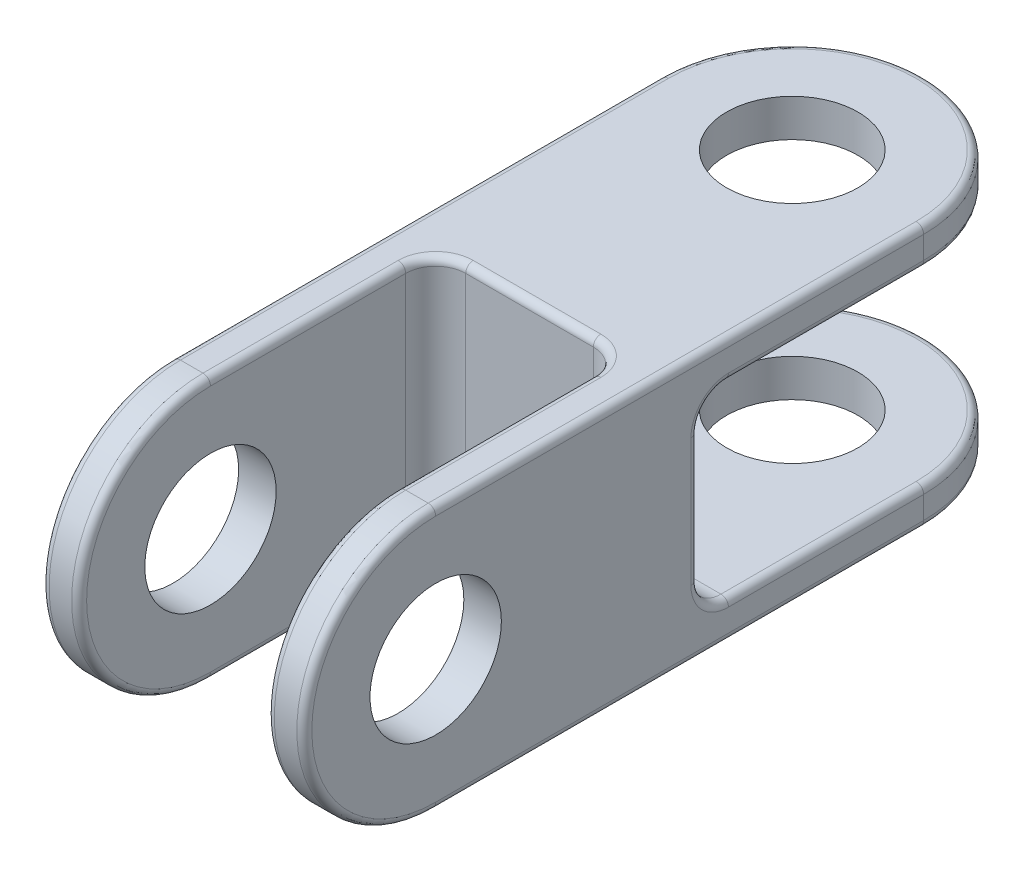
ISO-10303-21;
HEADER;
FILE_DESCRIPTION(('STEP AP214'),'2;1');
FILE_NAME('part.step','',(''),(''),'','','');
FILE_SCHEMA(('AUTOMOTIVE_DESIGN { 1 0 10303 214 1 1 1 1 }'));
ENDSEC;
DATA;
#1=APPLICATION_CONTEXT('core data for automotive mechanical design processes');
#2=APPLICATION_PROTOCOL_DEFINITION('international standard','automotive_design',2000,#1);
#3=PRODUCT_CONTEXT('',#1,'mechanical');
#4=PRODUCT('Part','Part','',(#3));
#5=PRODUCT_RELATED_PRODUCT_CATEGORY('part','',(#4));
#6=PRODUCT_DEFINITION_FORMATION('','',#4);
#7=PRODUCT_DEFINITION_CONTEXT('part definition',#1,'design');
#8=PRODUCT_DEFINITION('design','',#6,#7);
#9=PRODUCT_DEFINITION_SHAPE('','',#8);
#10=(LENGTH_UNIT() NAMED_UNIT(*) SI_UNIT(.MILLI.,.METRE.));
#11=(NAMED_UNIT(*) PLANE_ANGLE_UNIT() SI_UNIT($,.RADIAN.));
#12=(NAMED_UNIT(*) SI_UNIT($,.STERADIAN.) SOLID_ANGLE_UNIT());
#13=UNCERTAINTY_MEASURE_WITH_UNIT(LENGTH_MEASURE(1.E-05),#10,'distance_accuracy_value','');
#14=(GEOMETRIC_REPRESENTATION_CONTEXT(3) GLOBAL_UNCERTAINTY_ASSIGNED_CONTEXT((#13)) GLOBAL_UNIT_ASSIGNED_CONTEXT((#10,
#11,#12)) REPRESENTATION_CONTEXT('',''));
#15=CARTESIAN_POINT('',(0.,0.,0.));
#16=DIRECTION('',(0.,0.,1.));
#17=DIRECTION('',(1.,0.,0.));
#18=AXIS2_PLACEMENT_3D('',#15,#16,#17);
#19=CARTESIAN_POINT('',(0.,0.,0.));
#20=DIRECTION('',(0.,0.,-1.));
#21=DIRECTION('',(-1.,0.,0.));
#22=AXIS2_PLACEMENT_3D('',#19,#20,#21);
#23=PLANE('',#22);
#24=DIRECTION('',(1.,0.,0.));
#25=VECTOR('',#24,1.);
#26=CARTESIAN_POINT('',(0.,18.,0.));
#27=LINE('',#26,#25);
#28=CARTESIAN_POINT('',(68.,18.,0.));
#29=VERTEX_POINT('',#28);
#30=CARTESIAN_POINT('',(2.,18.,0.));
#31=VERTEX_POINT('',#30);
#32=EDGE_CURVE('E529',#29,#31,#27,.F.);
#33=ORIENTED_EDGE('',*,*,#32,.T.);
#34=DIRECTION('',(0.,-1.,0.));
#35=VECTOR('',#34,1.);
#36=CARTESIAN_POINT('',(1.99999999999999,52.,0.));
#37=LINE('',#36,#35);
#38=CARTESIAN_POINT('',(1.99999999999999,52.,0.));
#39=VERTEX_POINT('',#38);
#40=EDGE_CURVE('E322',#31,#39,#37,.F.);
#41=ORIENTED_EDGE('',*,*,#40,.T.);
#42=DIRECTION('',(1.,0.,0.));
#43=VECTOR('',#42,1.);
#44=CARTESIAN_POINT('',(70.,52.,0.));
#45=LINE('',#44,#43);
#46=CARTESIAN_POINT('',(68.,52.,0.));
#47=VERTEX_POINT('',#46);
#48=EDGE_CURVE('E532',#39,#47,#45,.T.);
#49=ORIENTED_EDGE('',*,*,#48,.T.);
#50=DIRECTION('',(0.,1.,0.));
#51=VECTOR('',#50,1.);
#52=CARTESIAN_POINT('',(68.,18.,0.));
#53=LINE('',#52,#51);
#54=EDGE_CURVE('E320',#47,#29,#53,.F.);
#55=ORIENTED_EDGE('',*,*,#54,.T.);
#56=EDGE_LOOP('',(#33,#41,#49,#55));
#57=FACE_BOUND('',#56,.T.);
#58=ADVANCED_FACE('F34',(#57),#23,.T.);
#59=CARTESIAN_POINT('',(0.,0.,10.));
#60=DIRECTION('',(0.,0.,-1.));
#61=DIRECTION('',(-1.,0.,0.));
#62=AXIS2_PLACEMENT_3D('',#59,#60,#61);
#63=PLANE('',#62);
#64=DIRECTION('',(0.,1.,0.));
#65=VECTOR('',#64,1.);
#66=CARTESIAN_POINT('',(52.,0.,10.));
#67=LINE('',#66,#65);
#68=CARTESIAN_POINT('',(52.,2.,10.));
#69=VERTEX_POINT('',#68);
#70=CARTESIAN_POINT('',(52.,68.,10.));
#71=VERTEX_POINT('',#70);
#72=EDGE_CURVE('E544',#69,#71,#67,.T.);
#73=ORIENTED_EDGE('',*,*,#72,.T.);
#74=DIRECTION('',(-1.,0.,0.));
#75=VECTOR('',#74,1.);
#76=CARTESIAN_POINT('',(0.,68.,10.));
#77=LINE('',#76,#75);
#78=CARTESIAN_POINT('',(18.,68.,10.));
#79=VERTEX_POINT('',#78);
#80=EDGE_CURVE('E362',#71,#79,#77,.T.);
#81=ORIENTED_EDGE('',*,*,#80,.T.);
#82=DIRECTION('',(0.,1.,0.));
#83=VECTOR('',#82,1.);
#84=CARTESIAN_POINT('',(18.,0.,10.));
#85=LINE('',#84,#83);
#86=CARTESIAN_POINT('',(18.,2.,10.));
#87=VERTEX_POINT('',#86);
#88=EDGE_CURVE('E541',#79,#87,#85,.F.);
#89=ORIENTED_EDGE('',*,*,#88,.T.);
#90=DIRECTION('',(1.,0.,0.));
#91=VECTOR('',#90,1.);
#92=CARTESIAN_POINT('',(0.,2.,10.));
#93=LINE('',#92,#91);
#94=EDGE_CURVE('E360',#87,#69,#93,.T.);
#95=ORIENTED_EDGE('',*,*,#94,.T.);
#96=EDGE_LOOP('',(#73,#81,#89,#95));
#97=FACE_BOUND('',#96,.T.);
#98=ADVANCED_FACE('F617',(#97),#63,.F.);
#99=CARTESIAN_POINT('',(0.,0.,10.));
#100=DIRECTION('',(1.,0.,0.));
#101=DIRECTION('',(0.,1.,0.));
#102=AXIS2_PLACEMENT_3D('',#99,#100,#101);
#103=PLANE('',#102);
#104=CARTESIAN_POINT('',(0.,18.,-8.));
#105=DIRECTION('',(1.,0.,0.));
#106=DIRECTION('',(0.,1.,0.));
#107=AXIS2_PLACEMENT_3D('',#104,#105,#106);
#108=CIRCLE('',#107,10.);
#109=CARTESIAN_POINT('',(0.,18.,2.));
#110=VERTEX_POINT('',#109);
#111=CARTESIAN_POINT('',(0.,7.99999999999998,-8.));
#112=VERTEX_POINT('',#111);
#113=EDGE_CURVE('E316',#110,#112,#108,.T.);
#114=ORIENTED_EDGE('',*,*,#113,.T.);
#115=DIRECTION('',(0.,0.,1.));
#116=VECTOR('',#115,1.);
#117=CARTESIAN_POINT('',(0.,7.99999999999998,10.));
#118=LINE('',#117,#116);
#119=CARTESIAN_POINT('',(0.,7.99999999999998,-60.));
#120=VERTEX_POINT('',#119);
#121=EDGE_CURVE('E318',#112,#120,#118,.F.);
#122=ORIENTED_EDGE('',*,*,#121,.T.);
#123=DIRECTION('',(0.,-1.,0.));
#124=VECTOR('',#123,1.);
#125=CARTESIAN_POINT('',(0.,9.99999999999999,-60.));
#126=LINE('',#125,#124);
#127=CARTESIAN_POINT('',(0.,2.,-60.));
#128=VERTEX_POINT('',#127);
#129=EDGE_CURVE('E250',#120,#128,#126,.T.);
#130=ORIENTED_EDGE('',*,*,#129,.T.);
#131=DIRECTION('',(0.,0.,-1.));
#132=VECTOR('',#131,1.);
#133=CARTESIAN_POINT('',(0.,2.,10.));
#134=LINE('',#133,#132);
#135=CARTESIAN_POINT('',(0.,1.99999999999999,70.));
#136=VERTEX_POINT('',#135);
#137=EDGE_CURVE('E308',#128,#136,#134,.F.);
#138=ORIENTED_EDGE('',*,*,#137,.T.);
#139=CARTESIAN_POINT('',(0.,35.,70.));
#140=DIRECTION('',(1.,0.,0.));
#141=DIRECTION('',(0.,1.,0.));
#142=AXIS2_PLACEMENT_3D('',#139,#140,#141);
#143=CIRCLE('',#142,33.);
#144=CARTESIAN_POINT('',(0.,68.,70.));
#145=VERTEX_POINT('',#144);
#146=EDGE_CURVE('E305',#136,#145,#143,.F.);
#147=ORIENTED_EDGE('',*,*,#146,.T.);
#148=DIRECTION('',(0.,0.,-1.));
#149=VECTOR('',#148,1.);
#150=CARTESIAN_POINT('',(0.,68.,10.));
#151=LINE('',#150,#149);
#152=CARTESIAN_POINT('',(0.,68.,-60.));
#153=VERTEX_POINT('',#152);
#154=EDGE_CURVE('E255',#145,#153,#151,.T.);
#155=ORIENTED_EDGE('',*,*,#154,.T.);
#156=DIRECTION('',(0.,-1.,0.));
#157=VECTOR('',#156,1.);
#158=CARTESIAN_POINT('',(0.,70.,-60.));
#159=LINE('',#158,#157);
#160=CARTESIAN_POINT('',(0.,62.,-60.));
#161=VERTEX_POINT('',#160);
#162=EDGE_CURVE('E499',#153,#161,#159,.T.);
#163=ORIENTED_EDGE('',*,*,#162,.T.);
#164=DIRECTION('',(0.,0.,1.));
#165=VECTOR('',#164,1.);
#166=CARTESIAN_POINT('',(0.,62.,-7.99999999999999));
#167=LINE('',#166,#165);
#168=CARTESIAN_POINT('',(0.,62.,-8.));
#169=VERTEX_POINT('',#168);
#170=EDGE_CURVE('E310',#161,#169,#167,.T.);
#171=ORIENTED_EDGE('',*,*,#170,.T.);
#172=CARTESIAN_POINT('',(0.,52.,-8.));
#173=DIRECTION('',(1.,0.,0.));
#174=DIRECTION('',(0.,1.,0.));
#175=AXIS2_PLACEMENT_3D('',#172,#173,#174);
#176=CIRCLE('',#175,10.);
#177=CARTESIAN_POINT('',(0.,52.,2.));
#178=VERTEX_POINT('',#177);
#179=EDGE_CURVE('E312',#169,#178,#176,.T.);
#180=ORIENTED_EDGE('',*,*,#179,.T.);
#181=DIRECTION('',(0.,-1.,0.));
#182=VECTOR('',#181,1.);
#183=CARTESIAN_POINT('',(0.,18.,2.));
#184=LINE('',#183,#182);
#185=EDGE_CURVE('E314',#178,#110,#184,.T.);
#186=ORIENTED_EDGE('',*,*,#185,.T.);
#187=EDGE_LOOP('',(#114,#122,#130,#138,#147,#155,#163,#171,#180,#186));
#188=FACE_BOUND('',#187,.T.);
#189=CARTESIAN_POINT('',(0.,35.,70.));
#190=DIRECTION('',(1.,0.,0.));
#191=DIRECTION('',(0.,0.,-1.));
#192=AXIS2_PLACEMENT_3D('',#189,#190,#191);
#193=CIRCLE('',#192,17.5);
#194=CARTESIAN_POINT('',(0.,35.,52.5));
#195=VERTEX_POINT('',#194);
#196=EDGE_CURVE('E517',#195,#195,#193,.T.);
#197=ORIENTED_EDGE('',*,*,#196,.T.);
#198=EDGE_LOOP('',(#197));
#199=FACE_BOUND('',#198,.T.);
#200=ADVANCED_FACE('F587',(#188,#199),#103,.F.);
#201=CARTESIAN_POINT('',(0.,0.,10.));
#202=DIRECTION('',(0.,1.,0.));
#203=DIRECTION('',(0.,0.,1.));
#204=AXIS2_PLACEMENT_3D('',#201,#202,#203);
#205=PLANE('',#204);
#206=DIRECTION('',(-1.,0.,0.));
#207=VECTOR('',#206,1.);
#208=CARTESIAN_POINT('',(70.,0.,70.));
#209=LINE('',#208,#207);
#210=CARTESIAN_POINT('',(68.,0.,70.));
#211=VERTEX_POINT('',#210);
#212=CARTESIAN_POINT('',(62.,0.,70.));
#213=VERTEX_POINT('',#212);
#214=EDGE_CURVE('E510',#211,#213,#209,.T.);
#215=ORIENTED_EDGE('',*,*,#214,.T.);
#216=DIRECTION('',(0.,0.,-1.));
#217=VECTOR('',#216,1.);
#218=CARTESIAN_POINT('',(62.,0.,18.));
#219=LINE('',#218,#217);
#220=CARTESIAN_POINT('',(62.,0.,18.));
#221=VERTEX_POINT('',#220);
#222=EDGE_CURVE('E392',#213,#221,#219,.T.);
#223=ORIENTED_EDGE('',*,*,#222,.T.);
#224=CARTESIAN_POINT('',(52.,0.,18.));
#225=DIRECTION('',(0.,1.,0.));
#226=DIRECTION('',(0.,0.,1.));
#227=AXIS2_PLACEMENT_3D('',#224,#225,#226);
#228=CIRCLE('',#227,10.);
#229=CARTESIAN_POINT('',(52.,0.,8.));
#230=VERTEX_POINT('',#229);
#231=EDGE_CURVE('E390',#221,#230,#228,.T.);
#232=ORIENTED_EDGE('',*,*,#231,.T.);
#233=DIRECTION('',(1.,0.,0.));
#234=VECTOR('',#233,1.);
#235=CARTESIAN_POINT('',(0.,0.,8.));
#236=LINE('',#235,#234);
#237=CARTESIAN_POINT('',(18.,0.,8.));
#238=VERTEX_POINT('',#237);
#239=EDGE_CURVE('E388',#230,#238,#236,.F.);
#240=ORIENTED_EDGE('',*,*,#239,.T.);
#241=CARTESIAN_POINT('',(18.,0.,18.));
#242=DIRECTION('',(0.,1.,0.));
#243=DIRECTION('',(0.,0.,1.));
#244=AXIS2_PLACEMENT_3D('',#241,#242,#243);
#245=CIRCLE('',#244,10.);
#246=CARTESIAN_POINT('',(7.99999999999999,0.,18.));
#247=VERTEX_POINT('',#246);
#248=EDGE_CURVE('E386',#238,#247,#245,.T.);
#249=ORIENTED_EDGE('',*,*,#248,.T.);
#250=DIRECTION('',(0.,0.,-1.));
#251=VECTOR('',#250,1.);
#252=CARTESIAN_POINT('',(7.99999999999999,0.,10.));
#253=LINE('',#252,#251);
#254=CARTESIAN_POINT('',(7.99999999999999,0.,70.));
#255=VERTEX_POINT('',#254);
#256=EDGE_CURVE('E384',#247,#255,#253,.F.);
#257=ORIENTED_EDGE('',*,*,#256,.T.);
#258=DIRECTION('',(-1.,0.,0.));
#259=VECTOR('',#258,1.);
#260=CARTESIAN_POINT('',(9.99999999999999,0.,70.));
#261=LINE('',#260,#259);
#262=CARTESIAN_POINT('',(2.,0.,70.));
#263=VERTEX_POINT('',#262);
#264=EDGE_CURVE('E521',#255,#263,#261,.T.);
#265=ORIENTED_EDGE('',*,*,#264,.T.);
#266=DIRECTION('',(0.,0.,-1.));
#267=VECTOR('',#266,1.);
#268=CARTESIAN_POINT('',(2.,0.,10.));
#269=LINE('',#268,#267);
#270=CARTESIAN_POINT('',(2.,0.,-60.));
#271=VERTEX_POINT('',#270);
#272=EDGE_CURVE('E382',#263,#271,#269,.T.);
#273=ORIENTED_EDGE('',*,*,#272,.T.);
#274=CARTESIAN_POINT('',(35.,0.,-60.));
#275=DIRECTION('',(0.,1.,0.));
#276=DIRECTION('',(0.,0.,1.));
#277=AXIS2_PLACEMENT_3D('',#274,#275,#276);
#278=CIRCLE('',#277,33.);
#279=CARTESIAN_POINT('',(68.,0.,-60.));
#280=VERTEX_POINT('',#279);
#281=EDGE_CURVE('E380',#271,#280,#278,.F.);
#282=ORIENTED_EDGE('',*,*,#281,.T.);
#283=DIRECTION('',(0.,0.,-1.));
#284=VECTOR('',#283,1.);
#285=CARTESIAN_POINT('',(68.,0.,10.));
#286=LINE('',#285,#284);
#287=EDGE_CURVE('E378',#280,#211,#286,.F.);
#288=ORIENTED_EDGE('',*,*,#287,.T.);
#289=EDGE_LOOP('',(#215,#223,#232,#240,#249,#257,#265,#273,#282,#288));
#290=FACE_BOUND('',#289,.T.);
#291=CARTESIAN_POINT('',(35.,0.,-60.));
#292=DIRECTION('',(0.,1.,0.));
#293=DIRECTION('',(0.,0.,1.));
#294=AXIS2_PLACEMENT_3D('',#291,#292,#293);
#295=CIRCLE('',#294,17.5);
#296=CARTESIAN_POINT('',(35.,0.,-42.5));
#297=VERTEX_POINT('',#296);
#298=EDGE_CURVE('E428',#297,#297,#295,.T.);
#299=ORIENTED_EDGE('',*,*,#298,.T.);
#300=EDGE_LOOP('',(#299));
#301=FACE_BOUND('',#300,.T.);
#302=ADVANCED_FACE('F633',(#290,#301),#205,.F.);
#303=CARTESIAN_POINT('',(70.,0.,10.));
#304=DIRECTION('',(-1.,0.,0.));
#305=DIRECTION('',(0.,-1.,0.));
#306=AXIS2_PLACEMENT_3D('',#303,#304,#305);
#307=PLANE('',#306);
#308=CARTESIAN_POINT('',(70.,35.,70.));
#309=DIRECTION('',(-1.,0.,0.));
#310=DIRECTION('',(0.,-1.,0.));
#311=AXIS2_PLACEMENT_3D('',#308,#309,#310);
#312=CIRCLE('',#311,33.);
#313=CARTESIAN_POINT('',(70.,68.,70.));
#314=VERTEX_POINT('',#313);
#315=CARTESIAN_POINT('',(70.,1.99999999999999,70.));
#316=VERTEX_POINT('',#315);
#317=EDGE_CURVE('E285',#314,#316,#312,.F.);
#318=ORIENTED_EDGE('',*,*,#317,.T.);
#319=DIRECTION('',(0.,0.,-1.));
#320=VECTOR('',#319,1.);
#321=CARTESIAN_POINT('',(70.,2.,10.));
#322=LINE('',#321,#320);
#323=CARTESIAN_POINT('',(70.,2.,-60.));
#324=VERTEX_POINT('',#323);
#325=EDGE_CURVE('E266',#316,#324,#322,.T.);
#326=ORIENTED_EDGE('',*,*,#325,.T.);
#327=DIRECTION('',(0.,-1.,0.));
#328=VECTOR('',#327,1.);
#329=CARTESIAN_POINT('',(70.,10.,-60.));
#330=LINE('',#329,#328);
#331=CARTESIAN_POINT('',(70.,7.99999999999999,-60.));
#332=VERTEX_POINT('',#331);
#333=EDGE_CURVE('E247',#332,#324,#330,.T.);
#334=ORIENTED_EDGE('',*,*,#333,.F.);
#335=DIRECTION('',(0.,0.,-1.));
#336=VECTOR('',#335,1.);
#337=CARTESIAN_POINT('',(70.,7.99999999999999,10.));
#338=LINE('',#337,#336);
#339=CARTESIAN_POINT('',(70.,7.99999999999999,-8.));
#340=VERTEX_POINT('',#339);
#341=EDGE_CURVE('E263',#332,#340,#338,.F.);
#342=ORIENTED_EDGE('',*,*,#341,.T.);
#343=CARTESIAN_POINT('',(70.,18.,-8.));
#344=DIRECTION('',(-1.,0.,0.));
#345=DIRECTION('',(0.,-1.,0.));
#346=AXIS2_PLACEMENT_3D('',#343,#344,#345);
#347=CIRCLE('',#346,10.);
#348=CARTESIAN_POINT('',(70.,18.,2.));
#349=VERTEX_POINT('',#348);
#350=EDGE_CURVE('E283',#340,#349,#347,.T.);
#351=ORIENTED_EDGE('',*,*,#350,.T.);
#352=DIRECTION('',(0.,1.,0.));
#353=VECTOR('',#352,1.);
#354=CARTESIAN_POINT('',(70.,52.,2.));
#355=LINE('',#354,#353);
#356=CARTESIAN_POINT('',(70.,52.,2.));
#357=VERTEX_POINT('',#356);
#358=EDGE_CURVE('E552',#349,#357,#355,.T.);
#359=ORIENTED_EDGE('',*,*,#358,.T.);
#360=CARTESIAN_POINT('',(70.,52.,-8.));
#361=DIRECTION('',(-1.,0.,0.));
#362=DIRECTION('',(0.,-1.,0.));
#363=AXIS2_PLACEMENT_3D('',#360,#361,#362);
#364=CIRCLE('',#363,10.);
#365=CARTESIAN_POINT('',(70.,62.,-8.));
#366=VERTEX_POINT('',#365);
#367=EDGE_CURVE('E554',#357,#366,#364,.T.);
#368=ORIENTED_EDGE('',*,*,#367,.T.);
#369=DIRECTION('',(0.,0.,-1.));
#370=VECTOR('',#369,1.);
#371=CARTESIAN_POINT('',(70.,62.,-60.));
#372=LINE('',#371,#370);
#373=CARTESIAN_POINT('',(70.,62.,-60.));
#374=VERTEX_POINT('',#373);
#375=EDGE_CURVE('E287',#366,#374,#372,.T.);
#376=ORIENTED_EDGE('',*,*,#375,.T.);
#377=DIRECTION('',(0.,-1.,0.));
#378=VECTOR('',#377,1.);
#379=CARTESIAN_POINT('',(70.,70.,-60.));
#380=LINE('',#379,#378);
#381=CARTESIAN_POINT('',(70.,68.,-60.));
#382=VERTEX_POINT('',#381);
#383=EDGE_CURVE('E494',#382,#374,#380,.T.);
#384=ORIENTED_EDGE('',*,*,#383,.F.);
#385=DIRECTION('',(0.,0.,-1.));
#386=VECTOR('',#385,1.);
#387=CARTESIAN_POINT('',(70.,68.,10.));
#388=LINE('',#387,#386);
#389=EDGE_CURVE('E282',#382,#314,#388,.F.);
#390=ORIENTED_EDGE('',*,*,#389,.T.);
#391=EDGE_LOOP('',(#318,#326,#334,#342,#351,#359,#368,#376,#384,#390));
#392=FACE_BOUND('',#391,.T.);
#393=CARTESIAN_POINT('',(70.,35.,70.));
#394=DIRECTION('',(1.,0.,0.));
#395=DIRECTION('',(0.,0.,-1.));
#396=AXIS2_PLACEMENT_3D('',#393,#394,#395);
#397=CIRCLE('',#396,17.5);
#398=CARTESIAN_POINT('',(70.,35.,52.5));
#399=VERTEX_POINT('',#398);
#400=EDGE_CURVE('E502',#399,#399,#397,.T.);
#401=ORIENTED_EDGE('',*,*,#400,.F.);
#402=EDGE_LOOP('',(#401));
#403=FACE_BOUND('',#402,.T.);
#404=ADVANCED_FACE('F259',(#392,#403),#307,.F.);
#405=CARTESIAN_POINT('',(0.,70.,10.));
#406=DIRECTION('',(0.,-1.,0.));
#407=DIRECTION('',(0.,0.,-1.));
#408=AXIS2_PLACEMENT_3D('',#405,#406,#407);
#409=PLANE('',#408);
#410=CARTESIAN_POINT('',(52.,70.,18.));
#411=DIRECTION('',(0.,-1.,0.));
#412=DIRECTION('',(0.,0.,-1.));
#413=AXIS2_PLACEMENT_3D('',#410,#411,#412);
#414=CIRCLE('',#413,10.);
#415=CARTESIAN_POINT('',(52.,70.,8.));
#416=VERTEX_POINT('',#415);
#417=CARTESIAN_POINT('',(62.,70.,18.));
#418=VERTEX_POINT('',#417);
#419=EDGE_CURVE('E351',#416,#418,#414,.T.);
#420=ORIENTED_EDGE('',*,*,#419,.T.);
#421=DIRECTION('',(0.,0.,1.));
#422=VECTOR('',#421,1.);
#423=CARTESIAN_POINT('',(62.,70.,70.));
#424=LINE('',#423,#422);
#425=CARTESIAN_POINT('',(62.,70.,70.));
#426=VERTEX_POINT('',#425);
#427=EDGE_CURVE('E353',#418,#426,#424,.T.);
#428=ORIENTED_EDGE('',*,*,#427,.T.);
#429=DIRECTION('',(-1.,0.,0.));
#430=VECTOR('',#429,1.);
#431=CARTESIAN_POINT('',(70.,70.,70.));
#432=LINE('',#431,#430);
#433=CARTESIAN_POINT('',(68.,70.,70.));
#434=VERTEX_POINT('',#433);
#435=EDGE_CURVE('E514',#434,#426,#432,.T.);
#436=ORIENTED_EDGE('',*,*,#435,.F.);
#437=DIRECTION('',(0.,0.,-1.));
#438=VECTOR('',#437,1.);
#439=CARTESIAN_POINT('',(68.,70.,10.));
#440=LINE('',#439,#438);
#441=CARTESIAN_POINT('',(68.,70.,-60.));
#442=VERTEX_POINT('',#441);
#443=EDGE_CURVE('E342',#434,#442,#440,.T.);
#444=ORIENTED_EDGE('',*,*,#443,.T.);
#445=CARTESIAN_POINT('',(35.,70.,-60.));
#446=DIRECTION('',(0.,-1.,0.));
#447=DIRECTION('',(0.,0.,-1.));
#448=AXIS2_PLACEMENT_3D('',#445,#446,#447);
#449=CIRCLE('',#448,33.);
#450=CARTESIAN_POINT('',(1.99999999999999,70.,-60.));
#451=VERTEX_POINT('',#450);
#452=EDGE_CURVE('E340',#442,#451,#449,.F.);
#453=ORIENTED_EDGE('',*,*,#452,.T.);
#454=DIRECTION('',(0.,0.,-1.));
#455=VECTOR('',#454,1.);
#456=CARTESIAN_POINT('',(1.99999999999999,70.,10.));
#457=LINE('',#456,#455);
#458=CARTESIAN_POINT('',(1.99999999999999,70.,70.));
#459=VERTEX_POINT('',#458);
#460=EDGE_CURVE('E338',#451,#459,#457,.F.);
#461=ORIENTED_EDGE('',*,*,#460,.T.);
#462=DIRECTION('',(-1.,0.,0.));
#463=VECTOR('',#462,1.);
#464=CARTESIAN_POINT('',(9.99999999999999,70.,70.));
#465=LINE('',#464,#463);
#466=CARTESIAN_POINT('',(7.99999999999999,70.,70.));
#467=VERTEX_POINT('',#466);
#468=EDGE_CURVE('E526',#467,#459,#465,.T.);
#469=ORIENTED_EDGE('',*,*,#468,.F.);
#470=DIRECTION('',(0.,0.,1.));
#471=VECTOR('',#470,1.);
#472=CARTESIAN_POINT('',(7.99999999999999,70.,10.));
#473=LINE('',#472,#471);
#474=CARTESIAN_POINT('',(7.99999999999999,70.,18.));
#475=VERTEX_POINT('',#474);
#476=EDGE_CURVE('E344',#467,#475,#473,.F.);
#477=ORIENTED_EDGE('',*,*,#476,.T.);
#478=CARTESIAN_POINT('',(18.,70.,18.));
#479=DIRECTION('',(0.,-1.,0.));
#480=DIRECTION('',(0.,0.,-1.));
#481=AXIS2_PLACEMENT_3D('',#478,#479,#480);
#482=CIRCLE('',#481,10.);
#483=CARTESIAN_POINT('',(18.,70.,8.));
#484=VERTEX_POINT('',#483);
#485=EDGE_CURVE('E346',#475,#484,#482,.T.);
#486=ORIENTED_EDGE('',*,*,#485,.T.);
#487=DIRECTION('',(-1.,0.,0.));
#488=VECTOR('',#487,1.);
#489=CARTESIAN_POINT('',(0.,70.,8.));
#490=LINE('',#489,#488);
#491=EDGE_CURVE('E349',#484,#416,#490,.F.);
#492=ORIENTED_EDGE('',*,*,#491,.T.);
#493=EDGE_LOOP('',(#420,#428,#436,#444,#453,#461,#469,#477,#486,#492));
#494=FACE_BOUND('',#493,.T.);
#495=CARTESIAN_POINT('',(35.,70.,-60.));
#496=DIRECTION('',(0.,1.,0.));
#497=DIRECTION('',(0.,0.,1.));
#498=AXIS2_PLACEMENT_3D('',#495,#496,#497);
#499=CIRCLE('',#498,17.5);
#500=CARTESIAN_POINT('',(35.,70.,-42.5));
#501=VERTEX_POINT('',#500);
#502=EDGE_CURVE('E505',#501,#501,#499,.T.);
#503=ORIENTED_EDGE('',*,*,#502,.F.);
#504=EDGE_LOOP('',(#503));
#505=FACE_BOUND('',#504,.T.);
#506=ADVANCED_FACE('F626',(#494,#505),#409,.F.);
#507=CARTESIAN_POINT('',(9.99999999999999,35.,70.));
#508=DIRECTION('',(-1.,0.,0.));
#509=DIRECTION('',(0.,0.,1.));
#510=AXIS2_PLACEMENT_3D('',#507,#508,#509);
#511=PLANE('',#510);
#512=CARTESIAN_POINT('',(9.99999999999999,35.,70.));
#513=DIRECTION('',(-1.,0.,0.));
#514=DIRECTION('',(0.,0.,1.));
#515=AXIS2_PLACEMENT_3D('',#512,#513,#514);
#516=CIRCLE('',#515,33.);
#517=CARTESIAN_POINT('',(9.99999999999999,68.,70.));
#518=VERTEX_POINT('',#517);
#519=CARTESIAN_POINT('',(9.99999999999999,1.99999999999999,70.));
#520=VERTEX_POINT('',#519);
#521=EDGE_CURVE('E51',#518,#520,#516,.F.);
#522=ORIENTED_EDGE('',*,*,#521,.T.);
#523=DIRECTION('',(0.,0.,-1.));
#524=VECTOR('',#523,1.);
#525=CARTESIAN_POINT('',(9.99999999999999,2.,70.));
#526=LINE('',#525,#524);
#527=CARTESIAN_POINT('',(9.99999999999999,2.,18.));
#528=VERTEX_POINT('',#527);
#529=EDGE_CURVE('E396',#520,#528,#526,.T.);
#530=ORIENTED_EDGE('',*,*,#529,.T.);
#531=DIRECTION('',(0.,1.,0.));
#532=VECTOR('',#531,1.);
#533=CARTESIAN_POINT('',(9.99999999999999,70.,18.));
#534=LINE('',#533,#532);
#535=CARTESIAN_POINT('',(9.99999999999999,68.,18.));
#536=VERTEX_POINT('',#535);
#537=EDGE_CURVE('E550',#528,#536,#534,.T.);
#538=ORIENTED_EDGE('',*,*,#537,.T.);
#539=DIRECTION('',(0.,0.,1.));
#540=VECTOR('',#539,1.);
#541=CARTESIAN_POINT('',(9.99999999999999,68.,70.));
#542=LINE('',#541,#540);
#543=EDGE_CURVE('E56',#536,#518,#542,.T.);
#544=ORIENTED_EDGE('',*,*,#543,.T.);
#545=EDGE_LOOP('',(#522,#530,#538,#544));
#546=FACE_BOUND('',#545,.T.);
#547=CARTESIAN_POINT('',(9.99999999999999,35.,70.));
#548=DIRECTION('',(1.,0.,0.));
#549=DIRECTION('',(0.,0.,-1.));
#550=AXIS2_PLACEMENT_3D('',#547,#548,#549);
#551=CIRCLE('',#550,17.5);
#552=CARTESIAN_POINT('',(9.99999999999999,35.,52.5));
#553=VERTEX_POINT('',#552);
#554=EDGE_CURVE('E518',#553,#553,#551,.T.);
#555=ORIENTED_EDGE('',*,*,#554,.F.);
#556=EDGE_LOOP('',(#555));
#557=FACE_BOUND('',#556,.T.);
#558=ADVANCED_FACE('F629',(#546,#557),#511,.F.);
#559=CARTESIAN_POINT('',(9.99999999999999,35.,70.));
#560=DIRECTION('',(-1.,0.,0.));
#561=DIRECTION('',(0.,0.,1.));
#562=AXIS2_PLACEMENT_3D('',#559,#560,#561);
#563=CYLINDRICAL_SURFACE('',#562,35.);
#564=ORIENTED_EDGE('',*,*,#264,.F.);
#565=CARTESIAN_POINT('',(7.99999999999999,35.,70.));
#566=DIRECTION('',(-1.,0.,0.));
#567=DIRECTION('',(0.,0.,1.));
#568=AXIS2_PLACEMENT_3D('',#565,#566,#567);
#569=CIRCLE('',#568,35.);
#570=EDGE_CURVE('E11',#255,#467,#569,.T.);
#571=ORIENTED_EDGE('',*,*,#570,.T.);
#572=ORIENTED_EDGE('',*,*,#468,.T.);
#573=CARTESIAN_POINT('',(1.99999999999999,35.,70.));
#574=DIRECTION('',(1.,0.,0.));
#575=DIRECTION('',(0.,1.,0.));
#576=AXIS2_PLACEMENT_3D('',#573,#574,#575);
#577=CIRCLE('',#576,35.);
#578=EDGE_CURVE('E43',#459,#263,#577,.T.);
#579=ORIENTED_EDGE('',*,*,#578,.T.);
#580=EDGE_LOOP('',(#564,#571,#572,#579));
#581=FACE_BOUND('',#580,.T.);
#582=ADVANCED_FACE('F1075',(#581),#563,.T.);
#583=CARTESIAN_POINT('',(9.99999999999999,35.,70.));
#584=DIRECTION('',(-1.,0.,0.));
#585=DIRECTION('',(0.,0.,1.));
#586=AXIS2_PLACEMENT_3D('',#583,#584,#585);
#587=CYLINDRICAL_SURFACE('',#586,17.5);
#588=ORIENTED_EDGE('',*,*,#554,.T.);
#589=EDGE_LOOP('',(#588));
#590=FACE_BOUND('',#589,.T.);
#591=ORIENTED_EDGE('',*,*,#196,.F.);
#592=EDGE_LOOP('',(#591));
#593=FACE_BOUND('',#592,.T.);
#594=ADVANCED_FACE('F1066',(#590,#593),#587,.F.);
#595=CARTESIAN_POINT('',(60.,35.,70.));
#596=DIRECTION('',(-1.,0.,0.));
#597=DIRECTION('',(0.,0.,1.));
#598=AXIS2_PLACEMENT_3D('',#595,#596,#597);
#599=PLANE('',#598);
#600=CARTESIAN_POINT('',(60.,35.,70.));
#601=DIRECTION('',(-1.,0.,0.));
#602=DIRECTION('',(0.,0.,1.));
#603=AXIS2_PLACEMENT_3D('',#600,#601,#602);
#604=CIRCLE('',#603,33.);
#605=CARTESIAN_POINT('',(60.,2.,70.));
#606=VERTEX_POINT('',#605);
#607=CARTESIAN_POINT('',(60.,68.,70.));
#608=VERTEX_POINT('',#607);
#609=EDGE_CURVE('E370',#606,#608,#604,.T.);
#610=ORIENTED_EDGE('',*,*,#609,.T.);
#611=DIRECTION('',(0.,0.,1.));
#612=VECTOR('',#611,1.);
#613=CARTESIAN_POINT('',(60.,68.,18.));
#614=LINE('',#613,#612);
#615=CARTESIAN_POINT('',(60.,68.,18.));
#616=VERTEX_POINT('',#615);
#617=EDGE_CURVE('E372',#608,#616,#614,.F.);
#618=ORIENTED_EDGE('',*,*,#617,.T.);
#619=DIRECTION('',(0.,1.,0.));
#620=VECTOR('',#619,1.);
#621=CARTESIAN_POINT('',(60.,35.,18.));
#622=LINE('',#621,#620);
#623=CARTESIAN_POINT('',(60.,2.,18.));
#624=VERTEX_POINT('',#623);
#625=EDGE_CURVE('E547',#616,#624,#622,.F.);
#626=ORIENTED_EDGE('',*,*,#625,.T.);
#627=DIRECTION('',(0.,0.,-1.));
#628=VECTOR('',#627,1.);
#629=CARTESIAN_POINT('',(60.,2.,70.));
#630=LINE('',#629,#628);
#631=EDGE_CURVE('E368',#624,#606,#630,.F.);
#632=ORIENTED_EDGE('',*,*,#631,.T.);
#633=EDGE_LOOP('',(#610,#618,#626,#632));
#634=FACE_BOUND('',#633,.T.);
#635=CARTESIAN_POINT('',(60.,35.,70.));
#636=DIRECTION('',(1.,0.,0.));
#637=DIRECTION('',(0.,0.,-1.));
#638=AXIS2_PLACEMENT_3D('',#635,#636,#637);
#639=CIRCLE('',#638,17.5);
#640=CARTESIAN_POINT('',(60.,35.,52.5));
#641=VERTEX_POINT('',#640);
#642=EDGE_CURVE('E498',#641,#641,#639,.T.);
#643=ORIENTED_EDGE('',*,*,#642,.T.);
#644=EDGE_LOOP('',(#643));
#645=FACE_BOUND('',#644,.T.);
#646=ADVANCED_FACE('F1056',(#634,#645),#599,.T.);
#647=CARTESIAN_POINT('',(70.,35.,70.));
#648=DIRECTION('',(-1.,0.,0.));
#649=DIRECTION('',(0.,0.,1.));
#650=AXIS2_PLACEMENT_3D('',#647,#648,#649);
#651=CYLINDRICAL_SURFACE('',#650,35.);
#652=ORIENTED_EDGE('',*,*,#435,.T.);
#653=CARTESIAN_POINT('',(62.,35.,70.));
#654=DIRECTION('',(-1.,0.,0.));
#655=DIRECTION('',(0.,0.,1.));
#656=AXIS2_PLACEMENT_3D('',#653,#654,#655);
#657=CIRCLE('',#656,35.);
#658=EDGE_CURVE('E376',#426,#213,#657,.F.);
#659=ORIENTED_EDGE('',*,*,#658,.T.);
#660=ORIENTED_EDGE('',*,*,#214,.F.);
#661=CARTESIAN_POINT('',(68.,35.,70.));
#662=DIRECTION('',(-1.,0.,0.));
#663=DIRECTION('',(0.,-1.,0.));
#664=AXIS2_PLACEMENT_3D('',#661,#662,#663);
#665=CIRCLE('',#664,35.);
#666=EDGE_CURVE('E374',#211,#434,#665,.T.);
#667=ORIENTED_EDGE('',*,*,#666,.T.);
#668=EDGE_LOOP('',(#652,#659,#660,#667));
#669=FACE_BOUND('',#668,.T.);
#670=ADVANCED_FACE('F1047',(#669),#651,.T.);
#671=CARTESIAN_POINT('',(70.,35.,70.));
#672=DIRECTION('',(-1.,0.,0.));
#673=DIRECTION('',(0.,0.,1.));
#674=AXIS2_PLACEMENT_3D('',#671,#672,#673);
#675=CYLINDRICAL_SURFACE('',#674,17.5);
#676=ORIENTED_EDGE('',*,*,#400,.T.);
#677=EDGE_LOOP('',(#676));
#678=FACE_BOUND('',#677,.T.);
#679=ORIENTED_EDGE('',*,*,#642,.F.);
#680=EDGE_LOOP('',(#679));
#681=FACE_BOUND('',#680,.T.);
#682=ADVANCED_FACE('F1038',(#678,#681),#675,.F.);
#683=CARTESIAN_POINT('',(35.,60.,-60.));
#684=DIRECTION('',(0.,-1.,0.));
#685=DIRECTION('',(0.,0.,-1.));
#686=AXIS2_PLACEMENT_3D('',#683,#684,#685);
#687=PLANE('',#686);
#688=DIRECTION('',(1.,0.,0.));
#689=VECTOR('',#688,1.);
#690=CARTESIAN_POINT('',(0.,60.,-8.));
#691=LINE('',#690,#689);
#692=CARTESIAN_POINT('',(68.,60.,-8.));
#693=VERTEX_POINT('',#692);
#694=CARTESIAN_POINT('',(1.99999999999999,60.,-8.));
#695=VERTEX_POINT('',#694);
#696=EDGE_CURVE('E535',#693,#695,#691,.F.);
#697=ORIENTED_EDGE('',*,*,#696,.T.);
#698=DIRECTION('',(0.,0.,1.));
#699=VECTOR('',#698,1.);
#700=CARTESIAN_POINT('',(1.99999999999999,60.,-60.));
#701=LINE('',#700,#699);
#702=CARTESIAN_POINT('',(1.99999999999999,60.,-60.));
#703=VERTEX_POINT('',#702);
#704=EDGE_CURVE('E332',#695,#703,#701,.F.);
#705=ORIENTED_EDGE('',*,*,#704,.T.);
#706=CARTESIAN_POINT('',(35.,60.,-60.));
#707=DIRECTION('',(0.,-1.,0.));
#708=DIRECTION('',(1.,0.,0.));
#709=AXIS2_PLACEMENT_3D('',#706,#707,#708);
#710=CIRCLE('',#709,33.);
#711=CARTESIAN_POINT('',(68.,60.,-60.));
#712=VERTEX_POINT('',#711);
#713=EDGE_CURVE('E330',#703,#712,#710,.T.);
#714=ORIENTED_EDGE('',*,*,#713,.T.);
#715=DIRECTION('',(0.,0.,-1.));
#716=VECTOR('',#715,1.);
#717=CARTESIAN_POINT('',(68.,60.,-8.));
#718=LINE('',#717,#716);
#719=EDGE_CURVE('E328',#712,#693,#718,.F.);
#720=ORIENTED_EDGE('',*,*,#719,.T.);
#721=EDGE_LOOP('',(#697,#705,#714,#720));
#722=FACE_BOUND('',#721,.T.);
#723=CARTESIAN_POINT('',(35.,60.,-60.));
#724=DIRECTION('',(0.,1.,0.));
#725=DIRECTION('',(0.,0.,1.));
#726=AXIS2_PLACEMENT_3D('',#723,#724,#725);
#727=CIRCLE('',#726,17.5);
#728=CARTESIAN_POINT('',(35.,60.,-42.5));
#729=VERTEX_POINT('',#728);
#730=EDGE_CURVE('E267',#729,#729,#727,.T.);
#731=ORIENTED_EDGE('',*,*,#730,.T.);
#732=EDGE_LOOP('',(#731));
#733=FACE_BOUND('',#732,.T.);
#734=ADVANCED_FACE('F596',(#722,#733),#687,.T.);
#735=CARTESIAN_POINT('',(35.,70.,-60.));
#736=DIRECTION('',(0.,-1.,0.));
#737=DIRECTION('',(0.,0.,-1.));
#738=AXIS2_PLACEMENT_3D('',#735,#736,#737);
#739=CYLINDRICAL_SURFACE('',#738,35.);
#740=ORIENTED_EDGE('',*,*,#383,.T.);
#741=CARTESIAN_POINT('',(35.,62.,-60.));
#742=DIRECTION('',(0.,-1.,0.));
#743=DIRECTION('',(1.,0.,0.));
#744=AXIS2_PLACEMENT_3D('',#741,#742,#743);
#745=CIRCLE('',#744,35.);
#746=EDGE_CURVE('E336',#374,#161,#745,.F.);
#747=ORIENTED_EDGE('',*,*,#746,.T.);
#748=ORIENTED_EDGE('',*,*,#162,.F.);
#749=CARTESIAN_POINT('',(35.,68.,-60.));
#750=DIRECTION('',(0.,-1.,0.));
#751=DIRECTION('',(0.,0.,-1.));
#752=AXIS2_PLACEMENT_3D('',#749,#750,#751);
#753=CIRCLE('',#752,35.);
#754=EDGE_CURVE('E334',#153,#382,#753,.T.);
#755=ORIENTED_EDGE('',*,*,#754,.T.);
#756=EDGE_LOOP('',(#740,#747,#748,#755));
#757=FACE_BOUND('',#756,.T.);
#758=ADVANCED_FACE('F603',(#757),#739,.T.);
#759=CARTESIAN_POINT('',(35.,70.,-60.));
#760=DIRECTION('',(0.,-1.,0.));
#761=DIRECTION('',(0.,0.,-1.));
#762=AXIS2_PLACEMENT_3D('',#759,#760,#761);
#763=CYLINDRICAL_SURFACE('',#762,17.5);
#764=ORIENTED_EDGE('',*,*,#502,.T.);
#765=EDGE_LOOP('',(#764));
#766=FACE_BOUND('',#765,.T.);
#767=ORIENTED_EDGE('',*,*,#730,.F.);
#768=EDGE_LOOP('',(#767));
#769=FACE_BOUND('',#768,.T.);
#770=ADVANCED_FACE('F1013',(#766,#769),#763,.F.);
#771=CARTESIAN_POINT('',(35.,9.99999999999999,-60.));
#772=DIRECTION('',(0.,-1.,0.));
#773=DIRECTION('',(0.,0.,-1.));
#774=AXIS2_PLACEMENT_3D('',#771,#772,#773);
#775=PLANE('',#774);
#776=DIRECTION('',(1.,0.,0.));
#777=VECTOR('',#776,1.);
#778=CARTESIAN_POINT('',(35.,9.99999999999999,-8.));
#779=LINE('',#778,#777);
#780=CARTESIAN_POINT('',(1.99999999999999,9.99999999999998,-8.));
#781=VERTEX_POINT('',#780);
#782=CARTESIAN_POINT('',(68.,9.99999999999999,-8.));
#783=VERTEX_POINT('',#782);
#784=EDGE_CURVE('E538',#781,#783,#779,.T.);
#785=ORIENTED_EDGE('',*,*,#784,.T.);
#786=DIRECTION('',(0.,0.,-1.));
#787=VECTOR('',#786,1.);
#788=CARTESIAN_POINT('',(68.,9.99999999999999,-60.));
#789=LINE('',#788,#787);
#790=CARTESIAN_POINT('',(68.,9.99999999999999,-60.));
#791=VERTEX_POINT('',#790);
#792=EDGE_CURVE('E301',#783,#791,#789,.T.);
#793=ORIENTED_EDGE('',*,*,#792,.T.);
#794=CARTESIAN_POINT('',(35.,9.99999999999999,-60.));
#795=DIRECTION('',(0.,-1.,0.));
#796=DIRECTION('',(1.,0.,0.));
#797=AXIS2_PLACEMENT_3D('',#794,#795,#796);
#798=CIRCLE('',#797,33.);
#799=CARTESIAN_POINT('',(2.,9.99999999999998,-60.));
#800=VERTEX_POINT('',#799);
#801=EDGE_CURVE('E273',#791,#800,#798,.F.);
#802=ORIENTED_EDGE('',*,*,#801,.T.);
#803=DIRECTION('',(0.,0.,1.));
#804=VECTOR('',#803,1.);
#805=CARTESIAN_POINT('',(2.,9.99999999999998,-60.));
#806=LINE('',#805,#804);
#807=EDGE_CURVE('E298',#800,#781,#806,.T.);
#808=ORIENTED_EDGE('',*,*,#807,.T.);
#809=EDGE_LOOP('',(#785,#793,#802,#808));
#810=FACE_BOUND('',#809,.T.);
#811=CARTESIAN_POINT('',(35.,9.99999999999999,-60.));
#812=DIRECTION('',(0.,1.,0.));
#813=DIRECTION('',(0.,0.,1.));
#814=AXIS2_PLACEMENT_3D('',#811,#812,#813);
#815=CIRCLE('',#814,17.5);
#816=CARTESIAN_POINT('',(35.,9.99999999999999,-42.5));
#817=VERTEX_POINT('',#816);
#818=EDGE_CURVE('E1206',#817,#817,#815,.T.);
#819=ORIENTED_EDGE('',*,*,#818,.F.);
#820=EDGE_LOOP('',(#819));
#821=FACE_BOUND('',#820,.T.);
#822=ADVANCED_FACE('F1007',(#810,#821),#775,.F.);
#823=CARTESIAN_POINT('',(35.,9.99999999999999,-60.));
#824=DIRECTION('',(0.,-1.,0.));
#825=DIRECTION('',(0.,0.,-1.));
#826=AXIS2_PLACEMENT_3D('',#823,#824,#825);
#827=CYLINDRICAL_SURFACE('',#826,35.);
#828=ORIENTED_EDGE('',*,*,#129,.F.);
#829=CARTESIAN_POINT('',(35.,7.99999999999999,-60.));
#830=DIRECTION('',(0.,-1.,0.));
#831=DIRECTION('',(1.,0.,0.));
#832=AXIS2_PLACEMENT_3D('',#829,#830,#831);
#833=CIRCLE('',#832,35.);
#834=EDGE_CURVE('E244',#120,#332,#833,.T.);
#835=ORIENTED_EDGE('',*,*,#834,.T.);
#836=ORIENTED_EDGE('',*,*,#333,.T.);
#837=CARTESIAN_POINT('',(35.,2.,-60.));
#838=DIRECTION('',(0.,1.,0.));
#839=DIRECTION('',(0.,0.,1.));
#840=AXIS2_PLACEMENT_3D('',#837,#838,#839);
#841=CIRCLE('',#840,35.);
#842=EDGE_CURVE('E256',#324,#128,#841,.T.);
#843=ORIENTED_EDGE('',*,*,#842,.T.);
#844=EDGE_LOOP('',(#828,#835,#836,#843));
#845=FACE_BOUND('',#844,.T.);
#846=ADVANCED_FACE('F246',(#845),#827,.T.);
#847=CARTESIAN_POINT('',(35.,9.99999999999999,-60.));
#848=DIRECTION('',(0.,-1.,0.));
#849=DIRECTION('',(0.,0.,-1.));
#850=AXIS2_PLACEMENT_3D('',#847,#848,#849);
#851=CYLINDRICAL_SURFACE('',#850,17.5);
#852=ORIENTED_EDGE('',*,*,#818,.T.);
#853=EDGE_LOOP('',(#852));
#854=FACE_BOUND('',#853,.T.);
#855=ORIENTED_EDGE('',*,*,#298,.F.);
#856=EDGE_LOOP('',(#855));
#857=FACE_BOUND('',#856,.T.);
#858=ADVANCED_FACE('F642',(#854,#857),#851,.F.);
#859=CARTESIAN_POINT('',(0.,52.,-8.));
#860=DIRECTION('',(-1.,0.,0.));
#861=DIRECTION('',(0.,-1.,0.));
#862=AXIS2_PLACEMENT_3D('',#859,#860,#861);
#863=CYLINDRICAL_SURFACE('',#862,8.);
#864=ORIENTED_EDGE('',*,*,#48,.F.);
#865=CARTESIAN_POINT('',(1.99999999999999,52.,-8.));
#866=DIRECTION('',(1.,0.,0.));
#867=DIRECTION('',(0.,1.,0.));
#868=AXIS2_PLACEMENT_3D('',#865,#866,#867);
#869=CIRCLE('',#868,8.);
#870=EDGE_CURVE('E326',#39,#695,#869,.F.);
#871=ORIENTED_EDGE('',*,*,#870,.T.);
#872=ORIENTED_EDGE('',*,*,#696,.F.);
#873=CARTESIAN_POINT('',(68.,52.,-8.));
#874=DIRECTION('',(-1.,0.,0.));
#875=DIRECTION('',(0.,-1.,0.));
#876=AXIS2_PLACEMENT_3D('',#873,#874,#875);
#877=CIRCLE('',#876,8.);
#878=EDGE_CURVE('E324',#693,#47,#877,.F.);
#879=ORIENTED_EDGE('',*,*,#878,.T.);
#880=EDGE_LOOP('',(#864,#871,#872,#879));
#881=FACE_BOUND('',#880,.T.);
#882=ADVANCED_FACE('F570',(#881),#863,.F.);
#883=CARTESIAN_POINT('',(35.,18.,-8.));
#884=DIRECTION('',(1.,0.,0.));
#885=DIRECTION('',(0.,1.,0.));
#886=AXIS2_PLACEMENT_3D('',#883,#884,#885);
#887=CYLINDRICAL_SURFACE('',#886,8.);
#888=ORIENTED_EDGE('',*,*,#32,.F.);
#889=CARTESIAN_POINT('',(68.,18.,-8.));
#890=DIRECTION('',(-1.,0.,0.));
#891=DIRECTION('',(0.,-1.,0.));
#892=AXIS2_PLACEMENT_3D('',#889,#890,#891);
#893=CIRCLE('',#892,8.);
#894=EDGE_CURVE('E295',#29,#783,#893,.F.);
#895=ORIENTED_EDGE('',*,*,#894,.T.);
#896=ORIENTED_EDGE('',*,*,#784,.F.);
#897=CARTESIAN_POINT('',(1.99999999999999,18.,-8.));
#898=DIRECTION('',(1.,0.,0.));
#899=DIRECTION('',(0.,1.,0.));
#900=AXIS2_PLACEMENT_3D('',#897,#898,#899);
#901=CIRCLE('',#900,8.);
#902=EDGE_CURVE('E293',#781,#31,#901,.F.);
#903=ORIENTED_EDGE('',*,*,#902,.T.);
#904=EDGE_LOOP('',(#888,#895,#896,#903));
#905=FACE_BOUND('',#904,.T.);
#906=ADVANCED_FACE('F641',(#905),#887,.F.);
#907=CARTESIAN_POINT('',(52.,0.,18.));
#908=DIRECTION('',(0.,1.,0.));
#909=DIRECTION('',(0.,0.,1.));
#910=AXIS2_PLACEMENT_3D('',#907,#908,#909);
#911=CYLINDRICAL_SURFACE('',#910,8.);
#912=ORIENTED_EDGE('',*,*,#625,.F.);
#913=CARTESIAN_POINT('',(52.,68.,18.));
#914=DIRECTION('',(0.,-1.,0.));
#915=DIRECTION('',(0.,0.,-1.));
#916=AXIS2_PLACEMENT_3D('',#913,#914,#915);
#917=CIRCLE('',#916,8.);
#918=EDGE_CURVE('E366',#616,#71,#917,.F.);
#919=ORIENTED_EDGE('',*,*,#918,.T.);
#920=ORIENTED_EDGE('',*,*,#72,.F.);
#921=CARTESIAN_POINT('',(52.,2.,18.));
#922=DIRECTION('',(0.,1.,0.));
#923=DIRECTION('',(0.,0.,1.));
#924=AXIS2_PLACEMENT_3D('',#921,#922,#923);
#925=CIRCLE('',#924,8.);
#926=EDGE_CURVE('E364',#69,#624,#925,.F.);
#927=ORIENTED_EDGE('',*,*,#926,.T.);
#928=EDGE_LOOP('',(#912,#919,#920,#927));
#929=FACE_BOUND('',#928,.T.);
#930=ADVANCED_FACE('F645',(#929),#911,.F.);
#931=CARTESIAN_POINT('',(18.,35.,18.));
#932=DIRECTION('',(0.,-1.,0.));
#933=DIRECTION('',(0.,0.,-1.));
#934=AXIS2_PLACEMENT_3D('',#931,#932,#933);
#935=CYLINDRICAL_SURFACE('',#934,8.);
#936=ORIENTED_EDGE('',*,*,#88,.F.);
#937=CARTESIAN_POINT('',(18.,68.,18.));
#938=DIRECTION('',(0.,-1.,0.));
#939=DIRECTION('',(0.,0.,-1.));
#940=AXIS2_PLACEMENT_3D('',#937,#938,#939);
#941=CIRCLE('',#940,8.);
#942=EDGE_CURVE('E357',#79,#536,#941,.F.);
#943=ORIENTED_EDGE('',*,*,#942,.T.);
#944=ORIENTED_EDGE('',*,*,#537,.F.);
#945=CARTESIAN_POINT('',(18.,2.,18.));
#946=DIRECTION('',(0.,1.,0.));
#947=DIRECTION('',(0.,0.,1.));
#948=AXIS2_PLACEMENT_3D('',#945,#946,#947);
#949=CIRCLE('',#948,8.);
#950=EDGE_CURVE('E355',#528,#87,#949,.F.);
#951=ORIENTED_EDGE('',*,*,#950,.T.);
#952=EDGE_LOOP('',(#936,#943,#944,#951));
#953=FACE_BOUND('',#952,.T.);
#954=ADVANCED_FACE('F649',(#953),#935,.F.);
#955=CARTESIAN_POINT('',(1.99999999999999,52.,-8.));
#956=DIRECTION('',(1.,0.,0.));
#957=DIRECTION('',(0.,1.,0.));
#958=AXIS2_PLACEMENT_3D('',#955,#956,#957);
#959=TOROIDAL_SURFACE('',#958,10.,2.);
#960=CARTESIAN_POINT('',(1.99999999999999,62.,-8.));
#961=DIRECTION('',(0.,0.,-1.));
#962=DIRECTION('',(-1.,0.,0.));
#963=AXIS2_PLACEMENT_3D('',#960,#961,#962);
#964=CIRCLE('',#963,2.);
#965=EDGE_CURVE('E422',#695,#169,#964,.T.);
#966=ORIENTED_EDGE('',*,*,#965,.F.);
#967=ORIENTED_EDGE('',*,*,#870,.F.);
#968=CARTESIAN_POINT('',(1.99999999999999,52.,2.));
#969=DIRECTION('',(0.,-1.,0.));
#970=DIRECTION('',(0.,0.,-1.));
#971=AXIS2_PLACEMENT_3D('',#968,#969,#970);
#972=CIRCLE('',#971,2.);
#973=EDGE_CURVE('E425',#178,#39,#972,.T.);
#974=ORIENTED_EDGE('',*,*,#973,.F.);
#975=ORIENTED_EDGE('',*,*,#179,.F.);
#976=EDGE_LOOP('',(#966,#967,#974,#975));
#977=FACE_BOUND('',#976,.T.);
#978=ADVANCED_FACE('F593',(#977),#959,.T.);
#979=CARTESIAN_POINT('',(2.,0.,2.));
#980=DIRECTION('',(0.,1.,0.));
#981=DIRECTION('',(-1.,0.,0.));
#982=AXIS2_PLACEMENT_3D('',#979,#980,#981);
#983=CYLINDRICAL_SURFACE('',#982,2.);
#984=ORIENTED_EDGE('',*,*,#973,.T.);
#985=ORIENTED_EDGE('',*,*,#40,.F.);
#986=CARTESIAN_POINT('',(2.,18.,2.));
#987=DIRECTION('',(0.,-1.,0.));
#988=DIRECTION('',(0.,0.,-1.));
#989=AXIS2_PLACEMENT_3D('',#986,#987,#988);
#990=CIRCLE('',#989,2.);
#991=EDGE_CURVE('E419',#110,#31,#990,.T.);
#992=ORIENTED_EDGE('',*,*,#991,.F.);
#993=ORIENTED_EDGE('',*,*,#185,.F.);
#994=EDGE_LOOP('',(#984,#985,#992,#993));
#995=FACE_BOUND('',#994,.T.);
#996=ADVANCED_FACE('F577',(#995),#983,.T.);
#997=CARTESIAN_POINT('',(1.99999999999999,62.,10.));
#998=DIRECTION('',(0.,0.,-1.));
#999=DIRECTION('',(-1.,0.,0.));
#1000=AXIS2_PLACEMENT_3D('',#997,#998,#999);
#1001=CYLINDRICAL_SURFACE('',#1000,2.);
#1002=ORIENTED_EDGE('',*,*,#965,.T.);
#1003=ORIENTED_EDGE('',*,*,#170,.F.);
#1004=CARTESIAN_POINT('',(1.99999999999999,62.,-60.));
#1005=DIRECTION('',(0.,0.,-1.));
#1006=DIRECTION('',(-1.,0.,0.));
#1007=AXIS2_PLACEMENT_3D('',#1004,#1005,#1006);
#1008=CIRCLE('',#1007,2.);
#1009=EDGE_CURVE('E416',#703,#161,#1008,.T.);
#1010=ORIENTED_EDGE('',*,*,#1009,.F.);
#1011=ORIENTED_EDGE('',*,*,#704,.F.);
#1012=EDGE_LOOP('',(#1002,#1003,#1010,#1011));
#1013=FACE_BOUND('',#1012,.T.);
#1014=ADVANCED_FACE('F607',(#1013),#1001,.T.);
#1015=CARTESIAN_POINT('',(1.99999999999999,18.,-8.));
#1016=DIRECTION('',(1.,0.,0.));
#1017=DIRECTION('',(0.,1.,0.));
#1018=AXIS2_PLACEMENT_3D('',#1015,#1016,#1017);
#1019=TOROIDAL_SURFACE('',#1018,10.,2.);
#1020=ORIENTED_EDGE('',*,*,#991,.T.);
#1021=ORIENTED_EDGE('',*,*,#902,.F.);
#1022=CARTESIAN_POINT('',(2.,7.99999999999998,-8.));
#1023=DIRECTION('',(0.,0.,-1.));
#1024=DIRECTION('',(-1.,0.,0.));
#1025=AXIS2_PLACEMENT_3D('',#1022,#1023,#1024);
#1026=CIRCLE('',#1025,2.);
#1027=EDGE_CURVE('E413',#112,#781,#1026,.T.);
#1028=ORIENTED_EDGE('',*,*,#1027,.F.);
#1029=ORIENTED_EDGE('',*,*,#113,.F.);
#1030=EDGE_LOOP('',(#1020,#1021,#1028,#1029));
#1031=FACE_BOUND('',#1030,.T.);
#1032=ADVANCED_FACE('F583',(#1031),#1019,.T.);
#1033=CARTESIAN_POINT('',(35.,62.,-60.));
#1034=DIRECTION('',(0.,-1.,0.));
#1035=DIRECTION('',(1.,0.,0.));
#1036=AXIS2_PLACEMENT_3D('',#1033,#1034,#1035);
#1037=TOROIDAL_SURFACE('',#1036,33.,2.);
#1038=ORIENTED_EDGE('',*,*,#1009,.T.);
#1039=ORIENTED_EDGE('',*,*,#746,.F.);
#1040=CARTESIAN_POINT('',(68.,62.,-60.));
#1041=DIRECTION('',(0.,0.,1.));
#1042=DIRECTION('',(1.,0.,0.));
#1043=AXIS2_PLACEMENT_3D('',#1040,#1041,#1042);
#1044=CIRCLE('',#1043,2.);
#1045=EDGE_CURVE('E410',#712,#374,#1044,.T.);
#1046=ORIENTED_EDGE('',*,*,#1045,.F.);
#1047=ORIENTED_EDGE('',*,*,#713,.F.);
#1048=EDGE_LOOP('',(#1038,#1039,#1046,#1047));
#1049=FACE_BOUND('',#1048,.T.);
#1050=ADVANCED_FACE('F601',(#1049),#1037,.T.);
#1051=CARTESIAN_POINT('',(2.,7.99999999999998,-60.));
#1052=DIRECTION('',(0.,0.,1.));
#1053=DIRECTION('',(1.,0.,0.));
#1054=AXIS2_PLACEMENT_3D('',#1051,#1052,#1053);
#1055=CYLINDRICAL_SURFACE('',#1054,2.);
#1056=ORIENTED_EDGE('',*,*,#1027,.T.);
#1057=ORIENTED_EDGE('',*,*,#807,.F.);
#1058=CARTESIAN_POINT('',(2.,7.99999999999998,-60.));
#1059=DIRECTION('',(0.,0.,-1.));
#1060=DIRECTION('',(-1.,0.,0.));
#1061=AXIS2_PLACEMENT_3D('',#1058,#1059,#1060);
#1062=CIRCLE('',#1061,2.);
#1063=EDGE_CURVE('E408',#120,#800,#1062,.T.);
#1064=ORIENTED_EDGE('',*,*,#1063,.F.);
#1065=ORIENTED_EDGE('',*,*,#121,.F.);
#1066=EDGE_LOOP('',(#1056,#1057,#1064,#1065));
#1067=FACE_BOUND('',#1066,.T.);
#1068=ADVANCED_FACE('F671',(#1067),#1055,.T.);
#1069=CARTESIAN_POINT('',(68.,62.,10.));
#1070=DIRECTION('',(0.,0.,1.));
#1071=DIRECTION('',(1.,0.,0.));
#1072=AXIS2_PLACEMENT_3D('',#1069,#1070,#1071);
#1073=CYLINDRICAL_SURFACE('',#1072,2.);
#1074=ORIENTED_EDGE('',*,*,#1045,.T.);
#1075=ORIENTED_EDGE('',*,*,#375,.F.);
#1076=CARTESIAN_POINT('',(68.,62.,-8.));
#1077=DIRECTION('',(0.,0.,1.));
#1078=DIRECTION('',(1.,0.,0.));
#1079=AXIS2_PLACEMENT_3D('',#1076,#1077,#1078);
#1080=CIRCLE('',#1079,2.);
#1081=EDGE_CURVE('E276',#693,#366,#1080,.T.);
#1082=ORIENTED_EDGE('',*,*,#1081,.F.);
#1083=ORIENTED_EDGE('',*,*,#719,.F.);
#1084=EDGE_LOOP('',(#1074,#1075,#1082,#1083));
#1085=FACE_BOUND('',#1084,.T.);
#1086=ADVANCED_FACE('F561',(#1085),#1073,.T.);
#1087=CARTESIAN_POINT('',(35.,7.99999999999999,-60.));
#1088=DIRECTION('',(0.,-1.,0.));
#1089=DIRECTION('',(1.,0.,0.));
#1090=AXIS2_PLACEMENT_3D('',#1087,#1088,#1089);
#1091=TOROIDAL_SURFACE('',#1090,33.,2.);
#1092=ORIENTED_EDGE('',*,*,#1063,.T.);
#1093=ORIENTED_EDGE('',*,*,#801,.F.);
#1094=CARTESIAN_POINT('',(68.,7.99999999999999,-60.));
#1095=DIRECTION('',(0.,0.,1.));
#1096=DIRECTION('',(1.,0.,0.));
#1097=AXIS2_PLACEMENT_3D('',#1094,#1095,#1096);
#1098=CIRCLE('',#1097,2.);
#1099=EDGE_CURVE('E271',#332,#791,#1098,.T.);
#1100=ORIENTED_EDGE('',*,*,#1099,.F.);
#1101=ORIENTED_EDGE('',*,*,#834,.F.);
#1102=EDGE_LOOP('',(#1092,#1093,#1100,#1101));
#1103=FACE_BOUND('',#1102,.T.);
#1104=ADVANCED_FACE('F272',(#1103),#1091,.T.);
#1105=CARTESIAN_POINT('',(68.,52.,-8.));
#1106=DIRECTION('',(-1.,0.,0.));
#1107=DIRECTION('',(0.,-1.,0.));
#1108=AXIS2_PLACEMENT_3D('',#1105,#1106,#1107);
#1109=TOROIDAL_SURFACE('',#1108,10.,2.);
#1110=ORIENTED_EDGE('',*,*,#1081,.T.);
#1111=ORIENTED_EDGE('',*,*,#367,.F.);
#1112=CARTESIAN_POINT('',(68.,52.,2.));
#1113=DIRECTION('',(0.,-1.,0.));
#1114=DIRECTION('',(0.,0.,-1.));
#1115=AXIS2_PLACEMENT_3D('',#1112,#1113,#1114);
#1116=CIRCLE('',#1115,2.);
#1117=EDGE_CURVE('E277',#47,#357,#1116,.T.);
#1118=ORIENTED_EDGE('',*,*,#1117,.F.);
#1119=ORIENTED_EDGE('',*,*,#878,.F.);
#1120=EDGE_LOOP('',(#1110,#1111,#1118,#1119));
#1121=FACE_BOUND('',#1120,.T.);
#1122=ADVANCED_FACE('F565',(#1121),#1109,.T.);
#1123=CARTESIAN_POINT('',(68.,7.99999999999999,-60.));
#1124=DIRECTION('',(0.,0.,-1.));
#1125=DIRECTION('',(-1.,0.,0.));
#1126=AXIS2_PLACEMENT_3D('',#1123,#1124,#1125);
#1127=CYLINDRICAL_SURFACE('',#1126,2.);
#1128=ORIENTED_EDGE('',*,*,#1099,.T.);
#1129=ORIENTED_EDGE('',*,*,#792,.F.);
#1130=CARTESIAN_POINT('',(68.,7.99999999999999,-8.));
#1131=DIRECTION('',(0.,0.,1.));
#1132=DIRECTION('',(1.,0.,0.));
#1133=AXIS2_PLACEMENT_3D('',#1130,#1131,#1132);
#1134=CIRCLE('',#1133,2.);
#1135=EDGE_CURVE('E280',#340,#783,#1134,.T.);
#1136=ORIENTED_EDGE('',*,*,#1135,.F.);
#1137=ORIENTED_EDGE('',*,*,#341,.F.);
#1138=EDGE_LOOP('',(#1128,#1129,#1136,#1137));
#1139=FACE_BOUND('',#1138,.T.);
#1140=ADVANCED_FACE('F279',(#1139),#1127,.T.);
#1141=CARTESIAN_POINT('',(68.,0.,2.));
#1142=DIRECTION('',(0.,-1.,0.));
#1143=DIRECTION('',(1.,0.,0.));
#1144=AXIS2_PLACEMENT_3D('',#1141,#1142,#1143);
#1145=CYLINDRICAL_SURFACE('',#1144,2.);
#1146=ORIENTED_EDGE('',*,*,#1117,.T.);
#1147=ORIENTED_EDGE('',*,*,#358,.F.);
#1148=CARTESIAN_POINT('',(68.,18.,2.));
#1149=DIRECTION('',(0.,-1.,0.));
#1150=DIRECTION('',(0.,0.,-1.));
#1151=AXIS2_PLACEMENT_3D('',#1148,#1149,#1150);
#1152=CIRCLE('',#1151,2.);
#1153=EDGE_CURVE('E400',#29,#349,#1152,.T.);
#1154=ORIENTED_EDGE('',*,*,#1153,.F.);
#1155=ORIENTED_EDGE('',*,*,#54,.F.);
#1156=EDGE_LOOP('',(#1146,#1147,#1154,#1155));
#1157=FACE_BOUND('',#1156,.T.);
#1158=ADVANCED_FACE('F658',(#1157),#1145,.T.);
#1159=CARTESIAN_POINT('',(68.,18.,-8.));
#1160=DIRECTION('',(-1.,0.,0.));
#1161=DIRECTION('',(0.,-1.,0.));
#1162=AXIS2_PLACEMENT_3D('',#1159,#1160,#1161);
#1163=TOROIDAL_SURFACE('',#1162,10.,2.);
#1164=ORIENTED_EDGE('',*,*,#1135,.T.);
#1165=ORIENTED_EDGE('',*,*,#894,.F.);
#1166=ORIENTED_EDGE('',*,*,#1153,.T.);
#1167=ORIENTED_EDGE('',*,*,#350,.F.);
#1168=EDGE_LOOP('',(#1164,#1165,#1166,#1167));
#1169=FACE_BOUND('',#1168,.T.);
#1170=ADVANCED_FACE('F654',(#1169),#1163,.T.);
#1171=CARTESIAN_POINT('',(52.,2.,18.));
#1172=DIRECTION('',(0.,1.,0.));
#1173=DIRECTION('',(0.,0.,1.));
#1174=AXIS2_PLACEMENT_3D('',#1171,#1172,#1173);
#1175=TOROIDAL_SURFACE('',#1174,10.,2.);
#1176=CARTESIAN_POINT('',(62.,2.,18.));
#1177=DIRECTION('',(0.,0.,1.));
#1178=DIRECTION('',(1.,0.,0.));
#1179=AXIS2_PLACEMENT_3D('',#1176,#1177,#1178);
#1180=CIRCLE('',#1179,2.);
#1181=EDGE_CURVE('E457',#624,#221,#1180,.T.);
#1182=ORIENTED_EDGE('',*,*,#1181,.F.);
#1183=ORIENTED_EDGE('',*,*,#926,.F.);
#1184=CARTESIAN_POINT('',(52.,2.,8.));
#1185=DIRECTION('',(-1.,0.,0.));
#1186=DIRECTION('',(0.,0.,1.));
#1187=AXIS2_PLACEMENT_3D('',#1184,#1185,#1186);
#1188=CIRCLE('',#1187,2.);
#1189=EDGE_CURVE('E402',#230,#69,#1188,.T.);
#1190=ORIENTED_EDGE('',*,*,#1189,.F.);
#1191=ORIENTED_EDGE('',*,*,#231,.F.);
#1192=EDGE_LOOP('',(#1182,#1183,#1190,#1191));
#1193=FACE_BOUND('',#1192,.T.);
#1194=ADVANCED_FACE('F657',(#1193),#1175,.T.);
#1195=CARTESIAN_POINT('',(0.,2.,8.));
#1196=DIRECTION('',(1.,0.,0.));
#1197=DIRECTION('',(0.,0.,-1.));
#1198=AXIS2_PLACEMENT_3D('',#1195,#1196,#1197);
#1199=CYLINDRICAL_SURFACE('',#1198,2.);
#1200=ORIENTED_EDGE('',*,*,#1189,.T.);
#1201=ORIENTED_EDGE('',*,*,#94,.F.);
#1202=CARTESIAN_POINT('',(18.,2.,8.));
#1203=DIRECTION('',(-1.,0.,0.));
#1204=DIRECTION('',(0.,0.,1.));
#1205=AXIS2_PLACEMENT_3D('',#1202,#1203,#1204);
#1206=CIRCLE('',#1205,2.);
#1207=EDGE_CURVE('E454',#238,#87,#1206,.T.);
#1208=ORIENTED_EDGE('',*,*,#1207,.F.);
#1209=ORIENTED_EDGE('',*,*,#239,.F.);
#1210=EDGE_LOOP('',(#1200,#1201,#1208,#1209));
#1211=FACE_BOUND('',#1210,.T.);
#1212=ADVANCED_FACE('F714',(#1211),#1199,.T.);
#1213=CARTESIAN_POINT('',(62.,2.,10.));
#1214=DIRECTION('',(0.,0.,1.));
#1215=DIRECTION('',(1.,0.,0.));
#1216=AXIS2_PLACEMENT_3D('',#1213,#1214,#1215);
#1217=CYLINDRICAL_SURFACE('',#1216,2.);
#1218=ORIENTED_EDGE('',*,*,#1181,.T.);
#1219=ORIENTED_EDGE('',*,*,#222,.F.);
#1220=CARTESIAN_POINT('',(62.,2.,70.));
#1221=DIRECTION('',(0.,0.,1.));
#1222=DIRECTION('',(1.,0.,0.));
#1223=AXIS2_PLACEMENT_3D('',#1220,#1221,#1222);
#1224=CIRCLE('',#1223,2.);
#1225=EDGE_CURVE('E451',#606,#213,#1224,.T.);
#1226=ORIENTED_EDGE('',*,*,#1225,.F.);
#1227=ORIENTED_EDGE('',*,*,#631,.F.);
#1228=EDGE_LOOP('',(#1218,#1219,#1226,#1227));
#1229=FACE_BOUND('',#1228,.T.);
#1230=ADVANCED_FACE('F722',(#1229),#1217,.T.);
#1231=CARTESIAN_POINT('',(18.,2.,18.));
#1232=DIRECTION('',(0.,1.,0.));
#1233=DIRECTION('',(0.,0.,1.));
#1234=AXIS2_PLACEMENT_3D('',#1231,#1232,#1233);
#1235=TOROIDAL_SURFACE('',#1234,10.,2.);
#1236=ORIENTED_EDGE('',*,*,#1207,.T.);
#1237=ORIENTED_EDGE('',*,*,#950,.F.);
#1238=CARTESIAN_POINT('',(7.99999999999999,2.,18.));
#1239=DIRECTION('',(0.,0.,1.));
#1240=DIRECTION('',(1.,0.,0.));
#1241=AXIS2_PLACEMENT_3D('',#1238,#1239,#1240);
#1242=CIRCLE('',#1241,2.);
#1243=EDGE_CURVE('E448',#247,#528,#1242,.T.);
#1244=ORIENTED_EDGE('',*,*,#1243,.F.);
#1245=ORIENTED_EDGE('',*,*,#248,.F.);
#1246=EDGE_LOOP('',(#1236,#1237,#1244,#1245));
#1247=FACE_BOUND('',#1246,.T.);
#1248=ADVANCED_FACE('F730',(#1247),#1235,.T.);
#1249=CARTESIAN_POINT('',(62.,35.,70.));
#1250=DIRECTION('',(-1.,0.,0.));
#1251=DIRECTION('',(0.,0.,1.));
#1252=AXIS2_PLACEMENT_3D('',#1249,#1250,#1251);
#1253=TOROIDAL_SURFACE('',#1252,33.,2.);
#1254=ORIENTED_EDGE('',*,*,#1225,.T.);
#1255=ORIENTED_EDGE('',*,*,#658,.F.);
#1256=CARTESIAN_POINT('',(62.,68.,70.));
#1257=DIRECTION('',(0.,0.,-1.));
#1258=DIRECTION('',(-1.,0.,0.));
#1259=AXIS2_PLACEMENT_3D('',#1256,#1257,#1258);
#1260=CIRCLE('',#1259,2.);
#1261=EDGE_CURVE('E445',#608,#426,#1260,.T.);
#1262=ORIENTED_EDGE('',*,*,#1261,.F.);
#1263=ORIENTED_EDGE('',*,*,#609,.F.);
#1264=EDGE_LOOP('',(#1254,#1255,#1262,#1263));
#1265=FACE_BOUND('',#1264,.T.);
#1266=ADVANCED_FACE('F738',(#1265),#1253,.T.);
#1267=CARTESIAN_POINT('',(7.99999999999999,2.,70.));
#1268=DIRECTION('',(0.,0.,-1.));
#1269=DIRECTION('',(-1.,0.,0.));
#1270=AXIS2_PLACEMENT_3D('',#1267,#1268,#1269);
#1271=CYLINDRICAL_SURFACE('',#1270,2.);
#1272=ORIENTED_EDGE('',*,*,#1243,.T.);
#1273=ORIENTED_EDGE('',*,*,#529,.F.);
#1274=CARTESIAN_POINT('',(7.99999999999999,2.,70.));
#1275=DIRECTION('',(0.,0.,1.));
#1276=DIRECTION('',(1.,0.,0.));
#1277=AXIS2_PLACEMENT_3D('',#1274,#1275,#1276);
#1278=CIRCLE('',#1277,2.);
#1279=EDGE_CURVE('E442',#255,#520,#1278,.T.);
#1280=ORIENTED_EDGE('',*,*,#1279,.F.);
#1281=ORIENTED_EDGE('',*,*,#256,.F.);
#1282=EDGE_LOOP('',(#1272,#1273,#1280,#1281));
#1283=FACE_BOUND('',#1282,.T.);
#1284=ADVANCED_FACE('F746',(#1283),#1271,.T.);
#1285=CARTESIAN_POINT('',(62.,68.,10.));
#1286=DIRECTION('',(0.,0.,-1.));
#1287=DIRECTION('',(-1.,0.,0.));
#1288=AXIS2_PLACEMENT_3D('',#1285,#1286,#1287);
#1289=CYLINDRICAL_SURFACE('',#1288,2.);
#1290=ORIENTED_EDGE('',*,*,#1261,.T.);
#1291=ORIENTED_EDGE('',*,*,#427,.F.);
#1292=CARTESIAN_POINT('',(62.,68.,18.));
#1293=DIRECTION('',(0.,0.,-1.));
#1294=DIRECTION('',(-1.,0.,0.));
#1295=AXIS2_PLACEMENT_3D('',#1292,#1293,#1294);
#1296=CIRCLE('',#1295,2.);
#1297=EDGE_CURVE('E439',#616,#418,#1296,.T.);
#1298=ORIENTED_EDGE('',*,*,#1297,.F.);
#1299=ORIENTED_EDGE('',*,*,#617,.F.);
#1300=EDGE_LOOP('',(#1290,#1291,#1298,#1299));
#1301=FACE_BOUND('',#1300,.T.);
#1302=ADVANCED_FACE('F754',(#1301),#1289,.T.);
#1303=CARTESIAN_POINT('',(7.99999999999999,35.,70.));
#1304=DIRECTION('',(-1.,0.,0.));
#1305=DIRECTION('',(0.,0.,1.));
#1306=AXIS2_PLACEMENT_3D('',#1303,#1304,#1305);
#1307=TOROIDAL_SURFACE('',#1306,33.,2.);
#1308=ORIENTED_EDGE('',*,*,#1279,.T.);
#1309=ORIENTED_EDGE('',*,*,#521,.F.);
#1310=CARTESIAN_POINT('',(7.99999999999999,68.,70.));
#1311=DIRECTION('',(0.,0.,-1.));
#1312=DIRECTION('',(-1.,0.,0.));
#1313=AXIS2_PLACEMENT_3D('',#1310,#1311,#1312);
#1314=CIRCLE('',#1313,2.);
#1315=EDGE_CURVE('E436',#467,#518,#1314,.T.);
#1316=ORIENTED_EDGE('',*,*,#1315,.F.);
#1317=ORIENTED_EDGE('',*,*,#570,.F.);
#1318=EDGE_LOOP('',(#1308,#1309,#1316,#1317));
#1319=FACE_BOUND('',#1318,.T.);
#1320=ADVANCED_FACE('F762',(#1319),#1307,.T.);
#1321=CARTESIAN_POINT('',(52.,68.,18.));
#1322=DIRECTION('',(0.,-1.,0.));
#1323=DIRECTION('',(0.,0.,-1.));
#1324=AXIS2_PLACEMENT_3D('',#1321,#1322,#1323);
#1325=TOROIDAL_SURFACE('',#1324,10.,2.);
#1326=ORIENTED_EDGE('',*,*,#1297,.T.);
#1327=ORIENTED_EDGE('',*,*,#419,.F.);
#1328=CARTESIAN_POINT('',(52.,68.,8.));
#1329=DIRECTION('',(-1.,0.,0.));
#1330=DIRECTION('',(0.,0.,1.));
#1331=AXIS2_PLACEMENT_3D('',#1328,#1329,#1330);
#1332=CIRCLE('',#1331,2.);
#1333=EDGE_CURVE('E433',#71,#416,#1332,.T.);
#1334=ORIENTED_EDGE('',*,*,#1333,.F.);
#1335=ORIENTED_EDGE('',*,*,#918,.F.);
#1336=EDGE_LOOP('',(#1326,#1327,#1334,#1335));
#1337=FACE_BOUND('',#1336,.T.);
#1338=ADVANCED_FACE('F770',(#1337),#1325,.T.);
#1339=CARTESIAN_POINT('',(7.99999999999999,68.,70.));
#1340=DIRECTION('',(0.,0.,1.));
#1341=DIRECTION('',(1.,0.,0.));
#1342=AXIS2_PLACEMENT_3D('',#1339,#1340,#1341);
#1343=CYLINDRICAL_SURFACE('',#1342,2.);
#1344=ORIENTED_EDGE('',*,*,#1315,.T.);
#1345=ORIENTED_EDGE('',*,*,#543,.F.);
#1346=CARTESIAN_POINT('',(7.99999999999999,68.,18.));
#1347=DIRECTION('',(0.,0.,-1.));
#1348=DIRECTION('',(-1.,0.,0.));
#1349=AXIS2_PLACEMENT_3D('',#1346,#1347,#1348);
#1350=CIRCLE('',#1349,2.);
#1351=EDGE_CURVE('E431',#475,#536,#1350,.T.);
#1352=ORIENTED_EDGE('',*,*,#1351,.F.);
#1353=ORIENTED_EDGE('',*,*,#476,.F.);
#1354=EDGE_LOOP('',(#1344,#1345,#1352,#1353));
#1355=FACE_BOUND('',#1354,.T.);
#1356=ADVANCED_FACE('F778',(#1355),#1343,.T.);
#1357=CARTESIAN_POINT('',(0.,68.,8.));
#1358=DIRECTION('',(-1.,0.,0.));
#1359=DIRECTION('',(0.,0.,1.));
#1360=AXIS2_PLACEMENT_3D('',#1357,#1358,#1359);
#1361=CYLINDRICAL_SURFACE('',#1360,2.);
#1362=ORIENTED_EDGE('',*,*,#1333,.T.);
#1363=ORIENTED_EDGE('',*,*,#491,.F.);
#1364=CARTESIAN_POINT('',(18.,68.,8.));
#1365=DIRECTION('',(-1.,0.,0.));
#1366=DIRECTION('',(0.,0.,1.));
#1367=AXIS2_PLACEMENT_3D('',#1364,#1365,#1366);
#1368=CIRCLE('',#1367,2.);
#1369=EDGE_CURVE('E429',#79,#484,#1368,.T.);
#1370=ORIENTED_EDGE('',*,*,#1369,.F.);
#1371=ORIENTED_EDGE('',*,*,#80,.F.);
#1372=EDGE_LOOP('',(#1362,#1363,#1370,#1371));
#1373=FACE_BOUND('',#1372,.T.);
#1374=ADVANCED_FACE('F786',(#1373),#1361,.T.);
#1375=CARTESIAN_POINT('',(18.,68.,18.));
#1376=DIRECTION('',(0.,-1.,0.));
#1377=DIRECTION('',(0.,0.,-1.));
#1378=AXIS2_PLACEMENT_3D('',#1375,#1376,#1377);
#1379=TOROIDAL_SURFACE('',#1378,10.,2.);
#1380=ORIENTED_EDGE('',*,*,#1351,.T.);
#1381=ORIENTED_EDGE('',*,*,#942,.F.);
#1382=ORIENTED_EDGE('',*,*,#1369,.T.);
#1383=ORIENTED_EDGE('',*,*,#485,.F.);
#1384=EDGE_LOOP('',(#1380,#1381,#1382,#1383));
#1385=FACE_BOUND('',#1384,.T.);
#1386=ADVANCED_FACE('F794',(#1385),#1379,.T.);
#1387=CARTESIAN_POINT('',(68.,35.,70.));
#1388=DIRECTION('',(-1.,0.,0.));
#1389=DIRECTION('',(0.,-1.,0.));
#1390=AXIS2_PLACEMENT_3D('',#1387,#1388,#1389);
#1391=TOROIDAL_SURFACE('',#1390,33.,2.);
#1392=CARTESIAN_POINT('',(68.,1.99999999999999,70.));
#1393=DIRECTION('',(0.,0.,-1.));
#1394=DIRECTION('',(-1.,0.,0.));
#1395=AXIS2_PLACEMENT_3D('',#1392,#1393,#1394);
#1396=CIRCLE('',#1395,2.);
#1397=EDGE_CURVE('E477',#316,#211,#1396,.T.);
#1398=ORIENTED_EDGE('',*,*,#1397,.F.);
#1399=ORIENTED_EDGE('',*,*,#317,.F.);
#1400=CARTESIAN_POINT('',(68.,68.,70.));
#1401=DIRECTION('',(0.,0.,-1.));
#1402=DIRECTION('',(-1.,0.,0.));
#1403=AXIS2_PLACEMENT_3D('',#1400,#1401,#1402);
#1404=CIRCLE('',#1403,2.);
#1405=EDGE_CURVE('E38',#434,#314,#1404,.T.);
#1406=ORIENTED_EDGE('',*,*,#1405,.F.);
#1407=ORIENTED_EDGE('',*,*,#666,.F.);
#1408=EDGE_LOOP('',(#1398,#1399,#1406,#1407));
#1409=FACE_BOUND('',#1408,.T.);
#1410=ADVANCED_FACE('F36',(#1409),#1391,.T.);
#1411=CARTESIAN_POINT('',(68.,68.,10.));
#1412=DIRECTION('',(0.,0.,-1.));
#1413=DIRECTION('',(-1.,0.,0.));
#1414=AXIS2_PLACEMENT_3D('',#1411,#1412,#1413);
#1415=CYLINDRICAL_SURFACE('',#1414,2.);
#1416=ORIENTED_EDGE('',*,*,#1405,.T.);
#1417=ORIENTED_EDGE('',*,*,#389,.F.);
#1418=CARTESIAN_POINT('',(68.,68.,-60.));
#1419=DIRECTION('',(0.,0.,-1.));
#1420=DIRECTION('',(-1.,0.,0.));
#1421=AXIS2_PLACEMENT_3D('',#1418,#1419,#1420);
#1422=CIRCLE('',#1421,2.);
#1423=EDGE_CURVE('E475',#442,#382,#1422,.T.);
#1424=ORIENTED_EDGE('',*,*,#1423,.F.);
#1425=ORIENTED_EDGE('',*,*,#443,.F.);
#1426=EDGE_LOOP('',(#1416,#1417,#1424,#1425));
#1427=FACE_BOUND('',#1426,.T.);
#1428=ADVANCED_FACE('F487',(#1427),#1415,.T.);
#1429=CARTESIAN_POINT('',(68.,2.,10.));
#1430=DIRECTION('',(0.,0.,-1.));
#1431=DIRECTION('',(-1.,0.,0.));
#1432=AXIS2_PLACEMENT_3D('',#1429,#1430,#1431);
#1433=CYLINDRICAL_SURFACE('',#1432,2.);
#1434=ORIENTED_EDGE('',*,*,#1397,.T.);
#1435=ORIENTED_EDGE('',*,*,#287,.F.);
#1436=CARTESIAN_POINT('',(68.,2.,-60.));
#1437=DIRECTION('',(0.,0.,-1.));
#1438=DIRECTION('',(-1.,0.,0.));
#1439=AXIS2_PLACEMENT_3D('',#1436,#1437,#1438);
#1440=CIRCLE('',#1439,2.);
#1441=EDGE_CURVE('E472',#324,#280,#1440,.T.);
#1442=ORIENTED_EDGE('',*,*,#1441,.F.);
#1443=ORIENTED_EDGE('',*,*,#325,.F.);
#1444=EDGE_LOOP('',(#1434,#1435,#1442,#1443));
#1445=FACE_BOUND('',#1444,.T.);
#1446=ADVANCED_FACE('F814',(#1445),#1433,.T.);
#1447=CARTESIAN_POINT('',(35.,68.,-60.));
#1448=DIRECTION('',(0.,-1.,0.));
#1449=DIRECTION('',(0.,0.,-1.));
#1450=AXIS2_PLACEMENT_3D('',#1447,#1448,#1449);
#1451=TOROIDAL_SURFACE('',#1450,33.,2.);
#1452=ORIENTED_EDGE('',*,*,#1423,.T.);
#1453=ORIENTED_EDGE('',*,*,#754,.F.);
#1454=CARTESIAN_POINT('',(1.99999999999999,68.,-60.));
#1455=DIRECTION('',(0.,0.,1.));
#1456=DIRECTION('',(1.,0.,0.));
#1457=AXIS2_PLACEMENT_3D('',#1454,#1455,#1456);
#1458=CIRCLE('',#1457,2.);
#1459=EDGE_CURVE('E469',#451,#153,#1458,.T.);
#1460=ORIENTED_EDGE('',*,*,#1459,.F.);
#1461=ORIENTED_EDGE('',*,*,#452,.F.);
#1462=EDGE_LOOP('',(#1452,#1453,#1460,#1461));
#1463=FACE_BOUND('',#1462,.T.);
#1464=ADVANCED_FACE('F820',(#1463),#1451,.T.);
#1465=CARTESIAN_POINT('',(35.,2.,-60.));
#1466=DIRECTION('',(0.,1.,0.));
#1467=DIRECTION('',(0.,0.,1.));
#1468=AXIS2_PLACEMENT_3D('',#1465,#1466,#1467);
#1469=TOROIDAL_SURFACE('',#1468,33.,2.);
#1470=ORIENTED_EDGE('',*,*,#1441,.T.);
#1471=ORIENTED_EDGE('',*,*,#281,.F.);
#1472=CARTESIAN_POINT('',(2.,2.,-60.));
#1473=DIRECTION('',(0.,0.,1.));
#1474=DIRECTION('',(1.,0.,0.));
#1475=AXIS2_PLACEMENT_3D('',#1472,#1473,#1474);
#1476=CIRCLE('',#1475,2.);
#1477=EDGE_CURVE('E466',#128,#271,#1476,.T.);
#1478=ORIENTED_EDGE('',*,*,#1477,.F.);
#1479=ORIENTED_EDGE('',*,*,#842,.F.);
#1480=EDGE_LOOP('',(#1470,#1471,#1478,#1479));
#1481=FACE_BOUND('',#1480,.T.);
#1482=ADVANCED_FACE('F827',(#1481),#1469,.T.);
#1483=CARTESIAN_POINT('',(1.99999999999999,68.,10.));
#1484=DIRECTION('',(0.,0.,-1.));
#1485=DIRECTION('',(-1.,0.,0.));
#1486=AXIS2_PLACEMENT_3D('',#1483,#1484,#1485);
#1487=CYLINDRICAL_SURFACE('',#1486,2.);
#1488=ORIENTED_EDGE('',*,*,#1459,.T.);
#1489=ORIENTED_EDGE('',*,*,#154,.F.);
#1490=CARTESIAN_POINT('',(1.99999999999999,68.,70.));
#1491=DIRECTION('',(0.,0.,1.));
#1492=DIRECTION('',(1.,0.,0.));
#1493=AXIS2_PLACEMENT_3D('',#1490,#1491,#1492);
#1494=CIRCLE('',#1493,2.);
#1495=EDGE_CURVE('E464',#459,#145,#1494,.T.);
#1496=ORIENTED_EDGE('',*,*,#1495,.F.);
#1497=ORIENTED_EDGE('',*,*,#460,.F.);
#1498=EDGE_LOOP('',(#1488,#1489,#1496,#1497));
#1499=FACE_BOUND('',#1498,.T.);
#1500=ADVANCED_FACE('F835',(#1499),#1487,.T.);
#1501=CARTESIAN_POINT('',(2.,2.,10.));
#1502=DIRECTION('',(0.,0.,-1.));
#1503=DIRECTION('',(-1.,0.,0.));
#1504=AXIS2_PLACEMENT_3D('',#1501,#1502,#1503);
#1505=CYLINDRICAL_SURFACE('',#1504,2.);
#1506=ORIENTED_EDGE('',*,*,#1477,.T.);
#1507=ORIENTED_EDGE('',*,*,#272,.F.);
#1508=CARTESIAN_POINT('',(2.,2.,70.));
#1509=DIRECTION('',(0.,0.,1.));
#1510=DIRECTION('',(1.,0.,0.));
#1511=AXIS2_PLACEMENT_3D('',#1508,#1509,#1510);
#1512=CIRCLE('',#1511,2.);
#1513=EDGE_CURVE('E462',#136,#263,#1512,.T.);
#1514=ORIENTED_EDGE('',*,*,#1513,.F.);
#1515=ORIENTED_EDGE('',*,*,#137,.F.);
#1516=EDGE_LOOP('',(#1506,#1507,#1514,#1515));
#1517=FACE_BOUND('',#1516,.T.);
#1518=ADVANCED_FACE('F843',(#1517),#1505,.T.);
#1519=CARTESIAN_POINT('',(1.99999999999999,35.,70.));
#1520=DIRECTION('',(1.,0.,0.));
#1521=DIRECTION('',(0.,1.,0.));
#1522=AXIS2_PLACEMENT_3D('',#1519,#1520,#1521);
#1523=TOROIDAL_SURFACE('',#1522,33.,2.);
#1524=ORIENTED_EDGE('',*,*,#1495,.T.);
#1525=ORIENTED_EDGE('',*,*,#146,.F.);
#1526=ORIENTED_EDGE('',*,*,#1513,.T.);
#1527=ORIENTED_EDGE('',*,*,#578,.F.);
#1528=EDGE_LOOP('',(#1524,#1525,#1526,#1527));
#1529=FACE_BOUND('',#1528,.T.);
#1530=ADVANCED_FACE('F851',(#1529),#1523,.T.);
#1531=CLOSED_SHELL('',(#58,#98,#200,#302,#404,#506,#558,#582,#594,#646,#670,#682,#734,#758,#770,
#822,#846,#858,#882,#906,#930,#954,#978,#996,#1014,#1032,#1050,#1068,#1086,#1104,#1122,#1140,
#1158,#1170,#1194,#1212,#1230,#1248,#1266,#1284,#1302,#1320,#1338,#1356,#1374,#1386,#1410,#1428,
#1446,#1464,#1482,#1500,#1518,#1530));
#1532=MANIFOLD_SOLID_BREP('B2',#1531);
#1533=ADVANCED_BREP_SHAPE_REPRESENTATION('',(#18,#1532),#14);
#1534=SHAPE_DEFINITION_REPRESENTATION(#9,#1533);
ENDSEC;
END-ISO-10303-21;
